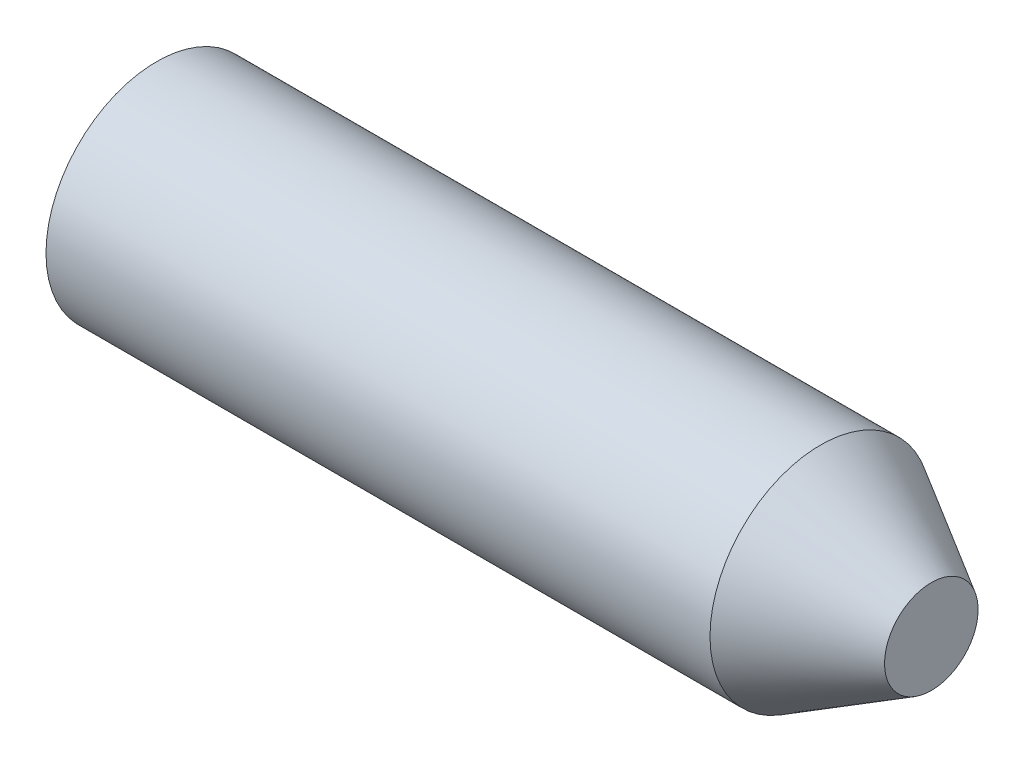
from build123d import *

# Parameters (mm, degrees)
F_16_0_16_DIAMETER_HOLE1_D     = 16
F_16_0_16_DIAMETER_HOLE1_DEPTH = 15
F_16_0_16_DIAMETER_HOLE1_TIP   = 4.806884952
M4_TAPPED_HOLE3_D              = 3.3
M4_TAPPED_HOLE3_DEPTH          = 12.1
M4_TAPPED_HOLE3_TIP            = 0.991420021


with BuildPart() as part:
    # Sketch2 → Revolve1 (revolve)
    with BuildSketch(Plane.XY, mode=Mode.PRIVATE) as revolve1_sk:
        Polygon((0, 10), (70, 10), (70, 14.226497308), (60, 20), (0, 20), align=None)
    revolve(revolve1_sk.sketch.rotate(Axis((0, 10, 0), (1, 0, 0)), 90), axis=Axis((0, 10, 0), (1, 0, 0)))

    # 16.0 _16_ Diameter Hole1
    with Locations(Plane(origin=(0, 10, 0), x_dir=(0, 0, -1), z_dir=(-1, 0, 0))):
        with Locations((0, 0)):
            Hole(F_16_0_16_DIAMETER_HOLE1_D / 2, depth=F_16_0_16_DIAMETER_HOLE1_DEPTH)
            with Locations((0, 0, -(F_16_0_16_DIAMETER_HOLE1_DEPTH + F_16_0_16_DIAMETER_HOLE1_TIP / 2))):  # 118° drill point
                Cone(0, F_16_0_16_DIAMETER_HOLE1_D / 2, F_16_0_16_DIAMETER_HOLE1_TIP, mode=Mode.SUBTRACT)

    # M4 Tapped Hole3
    with Locations(Plane(origin=(30, 0, 0), x_dir=(0, 0, -1), z_dir=(0, -1, 0))):
        with Locations((0, 0)):
            Hole(M4_TAPPED_HOLE3_D / 2, depth=M4_TAPPED_HOLE3_DEPTH)
            with Locations((0, 0, -(M4_TAPPED_HOLE3_DEPTH + M4_TAPPED_HOLE3_TIP / 2))):  # 118° drill point
                Cone(0, M4_TAPPED_HOLE3_D / 2, M4_TAPPED_HOLE3_TIP, mode=Mode.SUBTRACT)


solid = part.part
